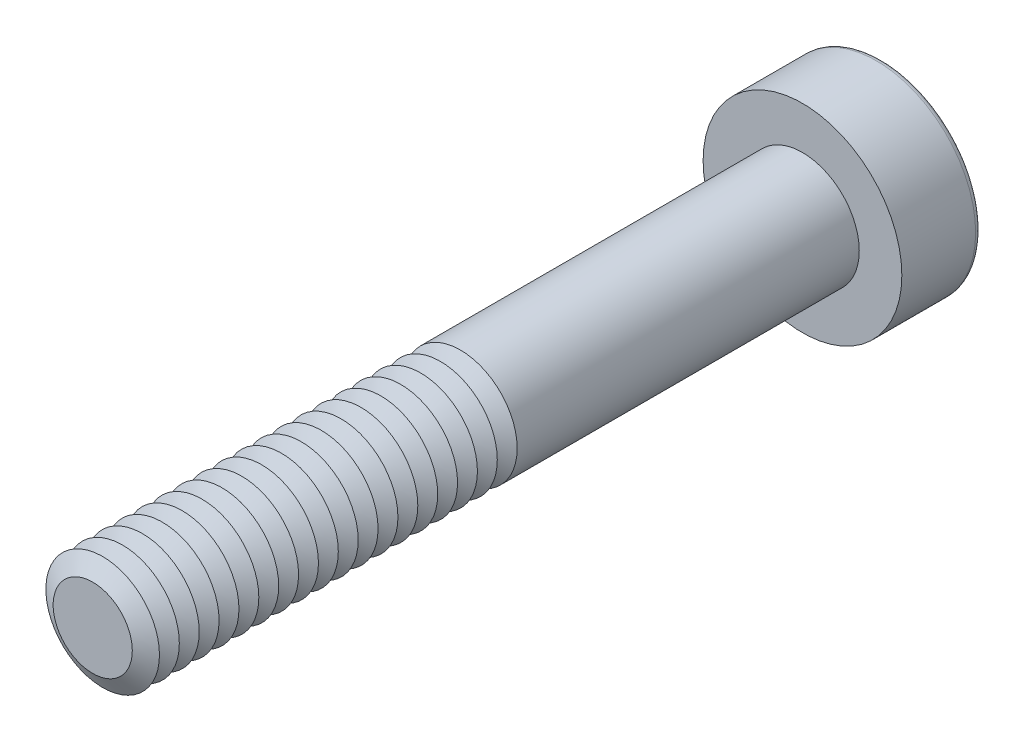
from build123d import *

# Parameters (mm, degrees)
SKETCH1_R           = 2
BOSS_EXTRUDE1_DEPTH = 25
SKETCH2_R           = 3.5
BOSS_EXTRUDE2_DEPTH = 2.8
CUT_EXTRUDE1_DEPTH  = 1.875
FILLET1_R           = 0.2
LPATTERN1_COUNT     = 19
LPATTERN1_PITCH     = 0.7


with BuildPart() as part:
    # Sketch1 → Boss-Extrude1 (new body)
    with BuildSketch(Plane.XY):
        Circle(SKETCH1_R)
    extrude(amount=BOSS_EXTRUDE1_DEPTH)

    # Sketch2 → Boss-Extrude2 (add)
    with BuildSketch(Plane(origin=(0, 0, 0), x_dir=(-1, 0, 0), z_dir=(0, 0, -1))):
        Circle(SKETCH2_R)
    extrude(amount=BOSS_EXTRUDE2_DEPTH)

    # Sketch3 → Cut-Extrude1 (cut)
    with BuildSketch(Plane(origin=(0, 0, -2.8), x_dir=(-1, 0, 0), z_dir=(0, 0, -1))):
        Polygon((-0.721687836, 1.25), (-1.443375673, 0), (-0.721687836, -1.25), (0.721687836, -1.25), (1.443375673, 0), (0.721687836, 1.25), align=None)
    extrude(amount=-CUT_EXTRUDE1_DEPTH, mode=Mode.SUBTRACT)

    # Fillet1
    fillet1_edges = [part.edges().sort_by_distance(p)[0] for p in [
        (3.5, 0, -2.8),
    ]]
    fillet(fillet1_edges, radius=FILLET1_R)

    # Cut-Extrude2 cone 1 section (on through the dimple's axis) → Cut-Extrude2 (revolve, cut)
    with BuildSketch(Plane(origin=(0, 0, -0.925), x_dir=(0, 1, 0), z_dir=(1, 0, 0))):
        Polygon((0, 0), (1.25, 0), (0, 0.721687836), align=None)
    revolve(axis=Axis((0, 0, -0.925), (0, 0, 1)), mode=Mode.SUBTRACT)

    # Cut-Extrude3 cone 1 section (on through the dimple's axis) → Cut-Extrude3 (revolve, cut)
    with BuildSketch(Plane(origin=(0, 0, -2.8), x_dir=(0, 1, 0), z_dir=(1, 0, 0))):
        Polygon((0, 0), (1.443375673, 0), (0, 0.386751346), align=None)
    revolve(axis=Axis((0, 0, -2.8), (0, 0, 1)), mode=Mode.SUBTRACT)

    # Sketch7 → Cut-Revolve1 (revolve, cut)
    with BuildSketch(Plane(origin=(0, 0, 0), x_dir=(0, 0, -1), z_dir=(1, 0, 0)), mode=Mode.PRIVATE) as cut_revolve1_sk:
        Polygon((-25, 1.393782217), (-24.65, 2), (-25.35, 2), align=None)
    cut_revolve1 = revolve(cut_revolve1_sk.sketch.rotate(Axis((0, 0, 25), (0, 0, -1)), 90), axis=Axis((0, 0, 25), (0, 0, -1)), mode=Mode.SUBTRACT)

    # LPattern1: Cut-Revolve1 ×19
    with Locations(*[(0, 0, -i * LPATTERN1_PITCH) for i in range(1, LPATTERN1_COUNT)]):
        add(cut_revolve1, mode=Mode.SUBTRACT)


solid = part.part
